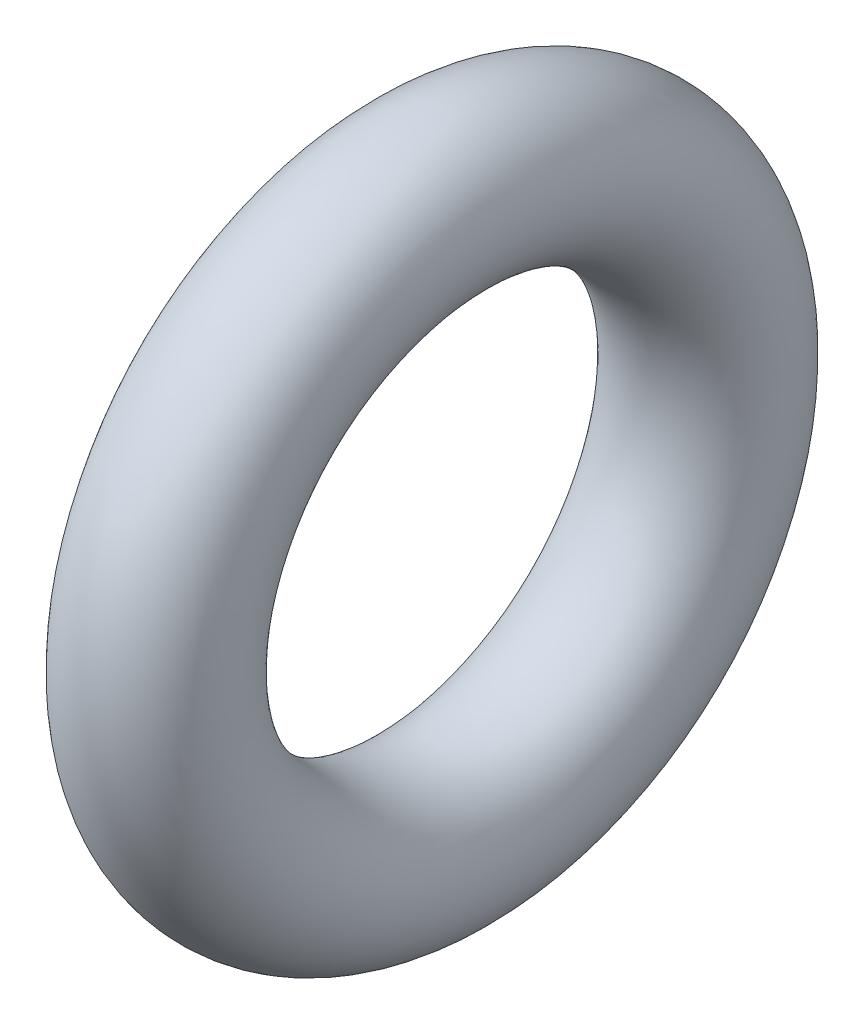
ISO-10303-21;
HEADER;
FILE_DESCRIPTION(('STEP AP214'),'2;1');
FILE_NAME('part.step','',(''),(''),'','','');
FILE_SCHEMA(('AUTOMOTIVE_DESIGN { 1 0 10303 214 1 1 1 1 }'));
ENDSEC;
DATA;
#1=APPLICATION_CONTEXT('core data for automotive mechanical design processes');
#2=APPLICATION_PROTOCOL_DEFINITION('international standard','automotive_design',2000,#1);
#3=PRODUCT_CONTEXT('',#1,'mechanical');
#4=PRODUCT('Part','Part','',(#3));
#5=PRODUCT_RELATED_PRODUCT_CATEGORY('part','',(#4));
#6=PRODUCT_DEFINITION_FORMATION('','',#4);
#7=PRODUCT_DEFINITION_CONTEXT('part definition',#1,'design');
#8=PRODUCT_DEFINITION('design','',#6,#7);
#9=PRODUCT_DEFINITION_SHAPE('','',#8);
#10=(LENGTH_UNIT() NAMED_UNIT(*) SI_UNIT(.MILLI.,.METRE.));
#11=(NAMED_UNIT(*) PLANE_ANGLE_UNIT() SI_UNIT($,.RADIAN.));
#12=(NAMED_UNIT(*) SI_UNIT($,.STERADIAN.) SOLID_ANGLE_UNIT());
#13=UNCERTAINTY_MEASURE_WITH_UNIT(LENGTH_MEASURE(1.E-05),#10,'distance_accuracy_value','');
#14=(GEOMETRIC_REPRESENTATION_CONTEXT(3) GLOBAL_UNCERTAINTY_ASSIGNED_CONTEXT((#13)) GLOBAL_UNIT_ASSIGNED_CONTEXT((#10,
#11,#12)) REPRESENTATION_CONTEXT('',''));
#15=CARTESIAN_POINT('',(0.,0.,0.));
#16=DIRECTION('',(0.,0.,1.));
#17=DIRECTION('',(1.,0.,0.));
#18=AXIS2_PLACEMENT_3D('',#15,#16,#17);
#19=CARTESIAN_POINT('',(2.5,0.,0.));
#20=DIRECTION('',(1.,0.,0.));
#21=DIRECTION('',(0.,-1.,0.));
#22=AXIS2_PLACEMENT_3D('',#19,#20,#21);
#23=TOROIDAL_SURFACE('',#22,4.25,1.2);
#24=CARTESIAN_POINT('',(2.5,-5.45,0.));
#25=VERTEX_POINT('',#24);
#26=VERTEX_LOOP('',#25);
#27=FACE_BOUND('',#26,.T.);
#28=ADVANCED_FACE('F13',(#27),#23,.T.);
#29=CLOSED_SHELL('',(#28));
#30=MANIFOLD_SOLID_BREP('B1',#29);
#31=ADVANCED_BREP_SHAPE_REPRESENTATION('',(#18,#30),#14);
#32=SHAPE_DEFINITION_REPRESENTATION(#9,#31);
ENDSEC;
END-ISO-10303-21;
